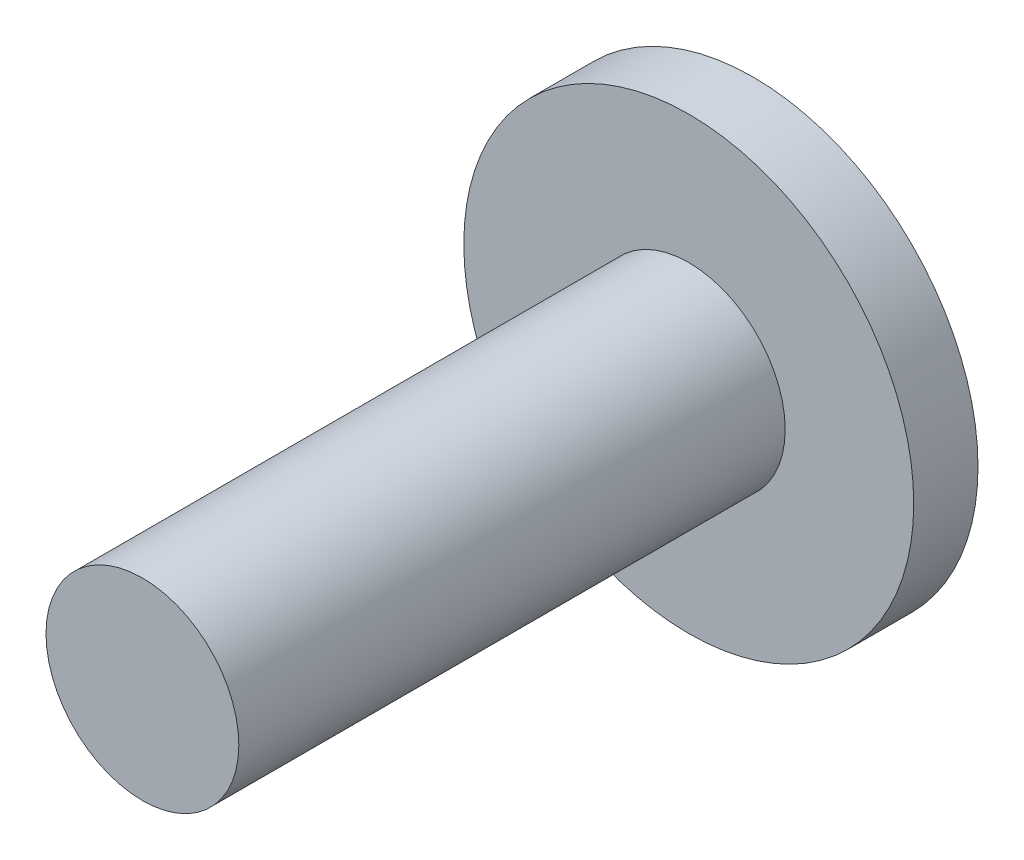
from build123d import *

# Parameters (mm, degrees)
SKETCH_1_R      = 7
EXTRUDE_1_DEPTH = 2
SKETCH_2_R      = 3
EXTRUDE_2_DEPTH = 17


with BuildPart() as part:
    # Sketch 1 → Extrude 1 (new body)
    with BuildSketch(Plane.XY):
        Circle(SKETCH_1_R)
    extrude(amount=EXTRUDE_1_DEPTH)

    # Sketch 2 → Extrude 2 (add)
    with BuildSketch(Plane.XY.offset(2)):
        Circle(SKETCH_2_R)
    extrude(amount=EXTRUDE_2_DEPTH)


solid = part.part
